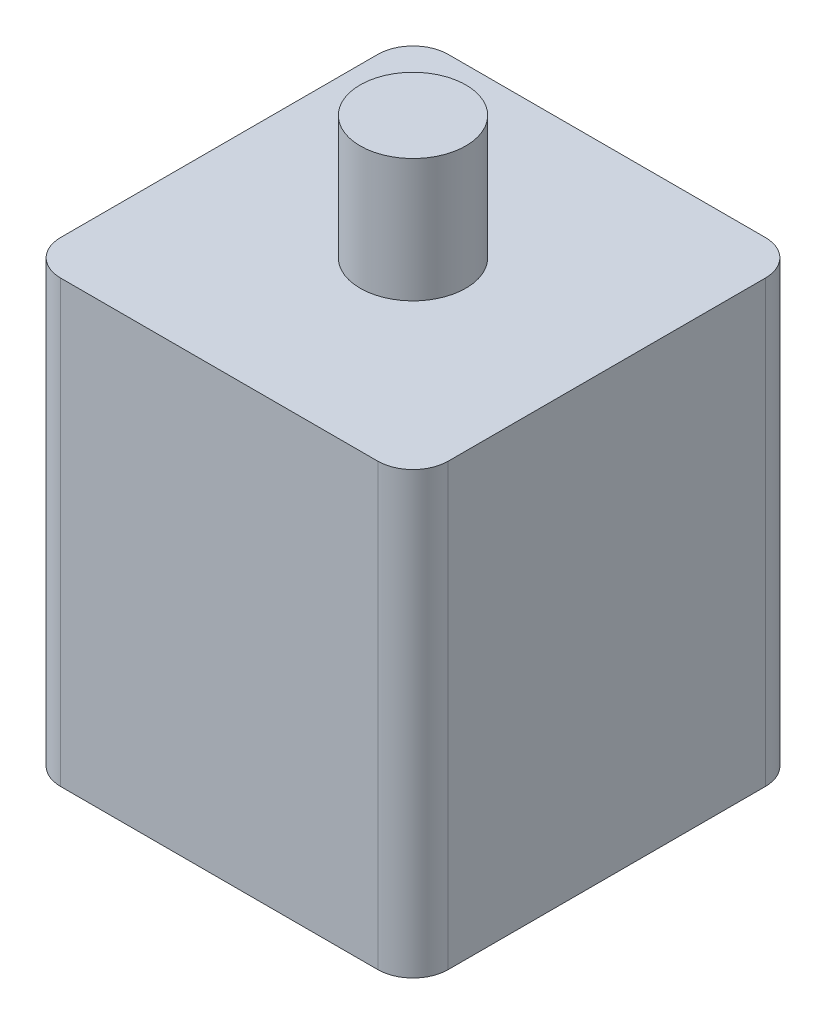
from build123d import *

# Parameters (mm, degrees)
SKETCH1_R           = 6
BOSS_EXTRUDE1_DEPTH = 25
SKETCH2_R           = 3
BOSS_EXTRUDE2_DEPTH = 7


with BuildPart() as part:
    # Sketch1 → Boss-Extrude1 (new body)
    # profile 1 of 2: a face of its own
    with BuildSketch(Plane(origin=(0, 0, 0), x_dir=(1, 0, 0), z_dir=(0, 1, 0))):
        with BuildLine():
            ThreePointArc((-11, 9), (-10.414213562, 10.414213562), (-9, 11))
            Line((-9, 11), (9, 11))
            ThreePointArc((9, 11), (10.414213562, 10.414213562), (11, 9))
            Line((11, 9), (11, -9))
            ThreePointArc((11, -9), (10.414213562, -10.414213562), (9, -11))
            Line((9, -11), (-9, -11))
            ThreePointArc((-9, -11), (-10.414213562, -10.414213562), (-11, -9))
            Line((-11, -9), (-11, 9))
        make_face()
        Circle(SKETCH1_R, mode=Mode.SUBTRACT)
    # profile 2 of 2: a face of its own
    with BuildSketch(Plane(origin=(0, 0, 0), x_dir=(1, 0, 0), z_dir=(0, 1, 0))):
        Circle(SKETCH1_R)
    extrude(amount=BOSS_EXTRUDE1_DEPTH)

    # Sketch2 → Boss-Extrude2 (add)
    with BuildSketch(Plane(origin=(0, 25, 0), x_dir=(1, 0, 0), z_dir=(0, 1, 0))):
        with Locations(Location((0, 0, 0), (0, 0, 270))):
            Circle(SKETCH2_R)
    extrude(amount=BOSS_EXTRUDE2_DEPTH)


solid = part.part
